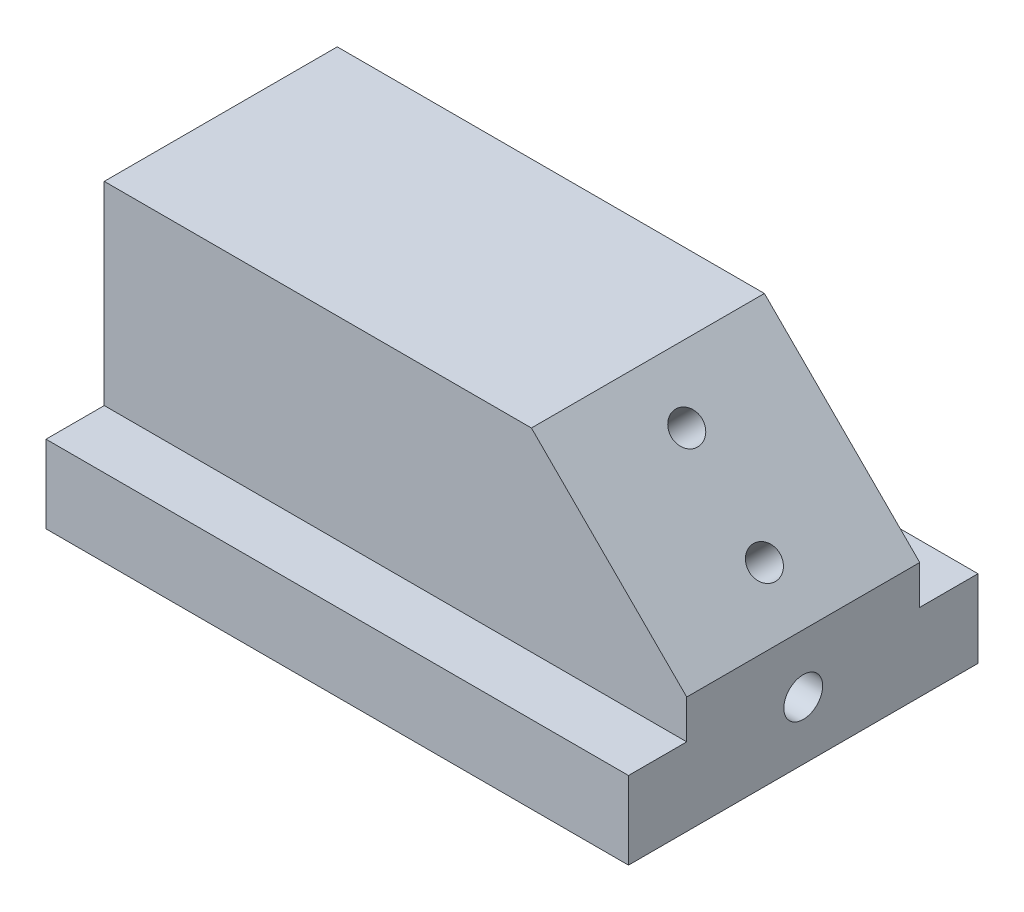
ISO-10303-21;
HEADER;
FILE_DESCRIPTION(('STEP AP214'),'2;1');
FILE_NAME('part.step','',(''),(''),'','','');
FILE_SCHEMA(('AUTOMOTIVE_DESIGN { 1 0 10303 214 1 1 1 1 }'));
ENDSEC;
DATA;
#1=APPLICATION_CONTEXT('core data for automotive mechanical design processes');
#2=APPLICATION_PROTOCOL_DEFINITION('international standard','automotive_design',2000,#1);
#3=PRODUCT_CONTEXT('',#1,'mechanical');
#4=PRODUCT('Part','Part','',(#3));
#5=PRODUCT_RELATED_PRODUCT_CATEGORY('part','',(#4));
#6=PRODUCT_DEFINITION_FORMATION('','',#4);
#7=PRODUCT_DEFINITION_CONTEXT('part definition',#1,'design');
#8=PRODUCT_DEFINITION('design','',#6,#7);
#9=PRODUCT_DEFINITION_SHAPE('','',#8);
#10=(LENGTH_UNIT() NAMED_UNIT(*) SI_UNIT(.MILLI.,.METRE.));
#11=(NAMED_UNIT(*) PLANE_ANGLE_UNIT() SI_UNIT($,.RADIAN.));
#12=(NAMED_UNIT(*) SI_UNIT($,.STERADIAN.) SOLID_ANGLE_UNIT());
#13=UNCERTAINTY_MEASURE_WITH_UNIT(LENGTH_MEASURE(1.E-05),#10,'distance_accuracy_value','');
#14=(GEOMETRIC_REPRESENTATION_CONTEXT(3) GLOBAL_UNCERTAINTY_ASSIGNED_CONTEXT((#13)) GLOBAL_UNIT_ASSIGNED_CONTEXT((#10,
#11,#12)) REPRESENTATION_CONTEXT('',''));
#15=CARTESIAN_POINT('',(0.,0.,0.));
#16=DIRECTION('',(0.,0.,1.));
#17=DIRECTION('',(1.,0.,0.));
#18=AXIS2_PLACEMENT_3D('',#15,#16,#17);
#19=CARTESIAN_POINT('',(-110.,0.,60.));
#20=DIRECTION('',(0.,-1.,0.));
#21=DIRECTION('',(0.,0.,-1.));
#22=AXIS2_PLACEMENT_3D('',#19,#20,#21);
#23=PLANE('',#22);
#24=DIRECTION('',(-1.,0.,0.));
#25=VECTOR('',#24,1.);
#26=CARTESIAN_POINT('',(-110.,0.,0.));
#27=LINE('',#26,#25);
#28=CARTESIAN_POINT('',(0.,0.,0.));
#29=VERTEX_POINT('',#28);
#30=CARTESIAN_POINT('',(-110.,0.,0.));
#31=VERTEX_POINT('',#30);
#32=EDGE_CURVE('E170',#29,#31,#27,.T.);
#33=ORIENTED_EDGE('',*,*,#32,.T.);
#34=DIRECTION('',(0.,0.,-1.));
#35=VECTOR('',#34,1.);
#36=CARTESIAN_POINT('',(-110.,0.,60.));
#37=LINE('',#36,#35);
#38=CARTESIAN_POINT('',(-110.,0.,60.));
#39=VERTEX_POINT('',#38);
#40=EDGE_CURVE('E11',#39,#31,#37,.T.);
#41=ORIENTED_EDGE('',*,*,#40,.F.);
#42=DIRECTION('',(-1.,0.,0.));
#43=VECTOR('',#42,1.);
#44=CARTESIAN_POINT('',(-110.,0.,60.));
#45=LINE('',#44,#43);
#46=CARTESIAN_POINT('',(0.,0.,60.));
#47=VERTEX_POINT('',#46);
#48=EDGE_CURVE('E171',#47,#39,#45,.T.);
#49=ORIENTED_EDGE('',*,*,#48,.F.);
#50=DIRECTION('',(0.,0.,-1.));
#51=VECTOR('',#50,1.);
#52=CARTESIAN_POINT('',(0.,0.,60.));
#53=LINE('',#52,#51);
#54=EDGE_CURVE('E181',#47,#29,#53,.T.);
#55=ORIENTED_EDGE('',*,*,#54,.T.);
#56=EDGE_LOOP('',(#33,#41,#49,#55));
#57=FACE_BOUND('',#56,.T.);
#58=ADVANCED_FACE('F33',(#57),#23,.F.);
#59=CARTESIAN_POINT('',(-110.,-70.,60.));
#60=DIRECTION('',(1.,0.,0.));
#61=DIRECTION('',(0.,0.,-1.));
#62=AXIS2_PLACEMENT_3D('',#59,#60,#61);
#63=PLANE('',#62);
#64=DIRECTION('',(0.,-1.,0.));
#65=VECTOR('',#64,1.);
#66=CARTESIAN_POINT('',(-110.,-70.,0.));
#67=LINE('',#66,#65);
#68=CARTESIAN_POINT('',(-110.,-50.,0.));
#69=VERTEX_POINT('',#68);
#70=EDGE_CURVE('E184',#31,#69,#67,.T.);
#71=ORIENTED_EDGE('',*,*,#70,.T.);
#72=DIRECTION('',(0.,0.,-1.));
#73=VECTOR('',#72,1.);
#74=CARTESIAN_POINT('',(-110.,-50.,0.));
#75=LINE('',#74,#73);
#76=CARTESIAN_POINT('',(-110.,-50.,-15.));
#77=VERTEX_POINT('',#76);
#78=EDGE_CURVE('E145',#69,#77,#75,.T.);
#79=ORIENTED_EDGE('',*,*,#78,.T.);
#80=DIRECTION('',(0.,-1.,0.));
#81=VECTOR('',#80,1.);
#82=CARTESIAN_POINT('',(-110.,-70.,-15.));
#83=LINE('',#82,#81);
#84=CARTESIAN_POINT('',(-110.,-70.,-15.));
#85=VERTEX_POINT('',#84);
#86=EDGE_CURVE('E142',#77,#85,#83,.T.);
#87=ORIENTED_EDGE('',*,*,#86,.T.);
#88=DIRECTION('',(0.,0.,-1.));
#89=VECTOR('',#88,1.);
#90=CARTESIAN_POINT('',(-110.,-70.,60.));
#91=LINE('',#90,#89);
#92=CARTESIAN_POINT('',(-110.,-70.,75.));
#93=VERTEX_POINT('',#92);
#94=EDGE_CURVE('E40',#93,#85,#91,.T.);
#95=ORIENTED_EDGE('',*,*,#94,.F.);
#96=DIRECTION('',(0.,1.,0.));
#97=VECTOR('',#96,1.);
#98=CARTESIAN_POINT('',(-110.,-70.,75.));
#99=LINE('',#98,#97);
#100=CARTESIAN_POINT('',(-110.,-50.,75.));
#101=VERTEX_POINT('',#100);
#102=EDGE_CURVE('E135',#93,#101,#99,.T.);
#103=ORIENTED_EDGE('',*,*,#102,.T.);
#104=DIRECTION('',(0.,0.,-1.));
#105=VECTOR('',#104,1.);
#106=CARTESIAN_POINT('',(-110.,-50.,60.));
#107=LINE('',#106,#105);
#108=CARTESIAN_POINT('',(-110.,-50.,60.));
#109=VERTEX_POINT('',#108);
#110=EDGE_CURVE('E112',#101,#109,#107,.T.);
#111=ORIENTED_EDGE('',*,*,#110,.T.);
#112=DIRECTION('',(0.,-1.,0.));
#113=VECTOR('',#112,1.);
#114=CARTESIAN_POINT('',(-110.,-70.,60.));
#115=LINE('',#114,#113);
#116=EDGE_CURVE('E174',#39,#109,#115,.T.);
#117=ORIENTED_EDGE('',*,*,#116,.F.);
#118=ORIENTED_EDGE('',*,*,#40,.T.);
#119=EDGE_LOOP('',(#71,#79,#87,#95,#103,#111,#117,#118));
#120=FACE_BOUND('',#119,.T.);
#121=ADVANCED_FACE('F201',(#120),#63,.F.);
#122=CARTESIAN_POINT('',(40.0000000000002,-70.,60.));
#123=DIRECTION('',(0.,1.,0.));
#124=DIRECTION('',(-1.,0.,0.));
#125=AXIS2_PLACEMENT_3D('',#122,#123,#124);
#126=PLANE('',#125);
#127=ORIENTED_EDGE('',*,*,#94,.T.);
#128=DIRECTION('',(1.,0.,0.));
#129=VECTOR('',#128,1.);
#130=CARTESIAN_POINT('',(-135.,-70.,-15.));
#131=LINE('',#130,#129);
#132=CARTESIAN_POINT('',(40.0000000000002,-70.,-15.));
#133=VERTEX_POINT('',#132);
#134=EDGE_CURVE('E153',#85,#133,#131,.T.);
#135=ORIENTED_EDGE('',*,*,#134,.T.);
#136=DIRECTION('',(0.,0.,-1.));
#137=VECTOR('',#136,1.);
#138=CARTESIAN_POINT('',(40.0000000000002,-70.,60.));
#139=LINE('',#138,#137);
#140=CARTESIAN_POINT('',(40.0000000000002,-70.,75.));
#141=VERTEX_POINT('',#140);
#142=EDGE_CURVE('E194',#141,#133,#139,.T.);
#143=ORIENTED_EDGE('',*,*,#142,.F.);
#144=DIRECTION('',(1.,0.,0.));
#145=VECTOR('',#144,1.);
#146=CARTESIAN_POINT('',(-135.,-70.,75.));
#147=LINE('',#146,#145);
#148=EDGE_CURVE('E115',#93,#141,#147,.T.);
#149=ORIENTED_EDGE('',*,*,#148,.F.);
#150=EDGE_LOOP('',(#127,#135,#143,#149));
#151=FACE_BOUND('',#150,.T.);
#152=ADVANCED_FACE('F196',(#151),#126,.F.);
#153=CARTESIAN_POINT('',(40.0000000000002,-40.,60.));
#154=DIRECTION('',(-1.,0.,0.));
#155=DIRECTION('',(0.,0.,1.));
#156=AXIS2_PLACEMENT_3D('',#153,#154,#155);
#157=PLANE('',#156);
#158=CARTESIAN_POINT('',(40.0000000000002,-55.,30.));
#159=DIRECTION('',(1.,0.,0.));
#160=DIRECTION('',(0.,0.,-1.));
#161=AXIS2_PLACEMENT_3D('',#158,#159,#160);
#162=CIRCLE('',#161,5.);
#163=CARTESIAN_POINT('',(40.0000000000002,-55.,25.));
#164=VERTEX_POINT('',#163);
#165=EDGE_CURVE('E132',#164,#164,#162,.T.);
#166=ORIENTED_EDGE('',*,*,#165,.F.);
#167=EDGE_LOOP('',(#166));
#168=FACE_BOUND('',#167,.T.);
#169=ORIENTED_EDGE('',*,*,#142,.T.);
#170=DIRECTION('',(0.,1.,0.));
#171=VECTOR('',#170,1.);
#172=CARTESIAN_POINT('',(40.0000000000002,-70.,-15.));
#173=LINE('',#172,#171);
#174=CARTESIAN_POINT('',(40.0000000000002,-50.,-15.));
#175=VERTEX_POINT('',#174);
#176=EDGE_CURVE('E141',#133,#175,#173,.T.);
#177=ORIENTED_EDGE('',*,*,#176,.T.);
#178=DIRECTION('',(0.,0.,1.));
#179=VECTOR('',#178,1.);
#180=CARTESIAN_POINT('',(40.0000000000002,-50.,0.));
#181=LINE('',#180,#179);
#182=CARTESIAN_POINT('',(40.0000000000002,-50.,0.));
#183=VERTEX_POINT('',#182);
#184=EDGE_CURVE('E150',#175,#183,#181,.T.);
#185=ORIENTED_EDGE('',*,*,#184,.T.);
#186=DIRECTION('',(0.,1.,0.));
#187=VECTOR('',#186,1.);
#188=CARTESIAN_POINT('',(40.0000000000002,-40.,0.));
#189=LINE('',#188,#187);
#190=CARTESIAN_POINT('',(40.0000000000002,-40.,0.));
#191=VERTEX_POINT('',#190);
#192=EDGE_CURVE('E186',#183,#191,#189,.T.);
#193=ORIENTED_EDGE('',*,*,#192,.T.);
#194=DIRECTION('',(0.,0.,-1.));
#195=VECTOR('',#194,1.);
#196=CARTESIAN_POINT('',(40.0000000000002,-40.,60.));
#197=LINE('',#196,#195);
#198=CARTESIAN_POINT('',(40.0000000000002,-40.,60.));
#199=VERTEX_POINT('',#198);
#200=EDGE_CURVE('E191',#199,#191,#197,.T.);
#201=ORIENTED_EDGE('',*,*,#200,.F.);
#202=DIRECTION('',(0.,1.,0.));
#203=VECTOR('',#202,1.);
#204=CARTESIAN_POINT('',(40.0000000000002,-40.,60.));
#205=LINE('',#204,#203);
#206=CARTESIAN_POINT('',(40.0000000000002,-50.,60.));
#207=VERTEX_POINT('',#206);
#208=EDGE_CURVE('E128',#207,#199,#205,.T.);
#209=ORIENTED_EDGE('',*,*,#208,.F.);
#210=DIRECTION('',(0.,0.,1.));
#211=VECTOR('',#210,1.);
#212=CARTESIAN_POINT('',(40.0000000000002,-50.,60.));
#213=LINE('',#212,#211);
#214=CARTESIAN_POINT('',(40.0000000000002,-50.,75.));
#215=VERTEX_POINT('',#214);
#216=EDGE_CURVE('E47',#207,#215,#213,.T.);
#217=ORIENTED_EDGE('',*,*,#216,.T.);
#218=DIRECTION('',(0.,-1.,0.));
#219=VECTOR('',#218,1.);
#220=CARTESIAN_POINT('',(40.0000000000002,-70.,75.));
#221=LINE('',#220,#219);
#222=EDGE_CURVE('E120',#215,#141,#221,.T.);
#223=ORIENTED_EDGE('',*,*,#222,.T.);
#224=EDGE_LOOP('',(#169,#177,#185,#193,#201,#209,#217,#223));
#225=FACE_BOUND('',#224,.T.);
#226=ADVANCED_FACE('F126',(#168,#225),#157,.F.);
#227=CARTESIAN_POINT('',(0.,0.,60.));
#228=DIRECTION('',(-0.707106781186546,-0.707106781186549,0.));
#229=DIRECTION('',(0.707106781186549,-0.707106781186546,0.));
#230=AXIS2_PLACEMENT_3D('',#227,#228,#229);
#231=PLANE('',#230);
#232=CARTESIAN_POINT('',(10.,-9.99999999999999,30.));
#233=DIRECTION('',(0.707106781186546,0.707106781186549,0.));
#234=DIRECTION('',(-0.707106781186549,0.707106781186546,0.));
#235=AXIS2_PLACEMENT_3D('',#232,#233,#234);
#236=CIRCLE('',#235,3.99999999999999);
#237=CARTESIAN_POINT('',(7.17157287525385,-7.17157287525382,30.));
#238=VERTEX_POINT('',#237);
#239=EDGE_CURVE('E147',#238,#238,#236,.T.);
#240=ORIENTED_EDGE('',*,*,#239,.F.);
#241=EDGE_LOOP('',(#240));
#242=FACE_BOUND('',#241,.T.);
#243=CARTESIAN_POINT('',(30.0000000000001,-30.,30.));
#244=DIRECTION('',(0.707106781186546,0.707106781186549,0.));
#245=DIRECTION('',(-0.707106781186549,0.707106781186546,0.));
#246=AXIS2_PLACEMENT_3D('',#243,#244,#245);
#247=CIRCLE('',#246,3.99999999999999);
#248=CARTESIAN_POINT('',(27.1715728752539,-27.1715728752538,30.));
#249=VERTEX_POINT('',#248);
#250=EDGE_CURVE('E164',#249,#249,#247,.T.);
#251=ORIENTED_EDGE('',*,*,#250,.F.);
#252=EDGE_LOOP('',(#251));
#253=FACE_BOUND('',#252,.T.);
#254=DIRECTION('',(-0.707106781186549,0.707106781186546,0.));
#255=VECTOR('',#254,1.);
#256=CARTESIAN_POINT('',(0.,0.,0.));
#257=LINE('',#256,#255);
#258=EDGE_CURVE('E175',#191,#29,#257,.T.);
#259=ORIENTED_EDGE('',*,*,#258,.T.);
#260=ORIENTED_EDGE('',*,*,#54,.F.);
#261=DIRECTION('',(-0.707106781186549,0.707106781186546,0.));
#262=VECTOR('',#261,1.);
#263=CARTESIAN_POINT('',(0.,0.,60.));
#264=LINE('',#263,#262);
#265=EDGE_CURVE('E179',#199,#47,#264,.T.);
#266=ORIENTED_EDGE('',*,*,#265,.F.);
#267=ORIENTED_EDGE('',*,*,#200,.T.);
#268=EDGE_LOOP('',(#259,#260,#266,#267));
#269=FACE_BOUND('',#268,.T.);
#270=ADVANCED_FACE('F238',(#242,#253,#269),#231,.F.);
#271=CARTESIAN_POINT('',(0.,0.,60.));
#272=DIRECTION('',(0.,0.,-1.));
#273=DIRECTION('',(-1.,0.,0.));
#274=AXIS2_PLACEMENT_3D('',#271,#272,#273);
#275=PLANE('',#274);
#276=ORIENTED_EDGE('',*,*,#116,.T.);
#277=DIRECTION('',(1.,0.,0.));
#278=VECTOR('',#277,1.);
#279=CARTESIAN_POINT('',(-135.,-50.,60.));
#280=LINE('',#279,#278);
#281=EDGE_CURVE('E116',#109,#207,#280,.T.);
#282=ORIENTED_EDGE('',*,*,#281,.T.);
#283=ORIENTED_EDGE('',*,*,#208,.T.);
#284=ORIENTED_EDGE('',*,*,#265,.T.);
#285=ORIENTED_EDGE('',*,*,#48,.T.);
#286=EDGE_LOOP('',(#276,#282,#283,#284,#285));
#287=FACE_BOUND('',#286,.T.);
#288=ADVANCED_FACE('F235',(#287),#275,.F.);
#289=CARTESIAN_POINT('',(0.,0.,0.));
#290=DIRECTION('',(0.,0.,-1.));
#291=DIRECTION('',(-1.,0.,0.));
#292=AXIS2_PLACEMENT_3D('',#289,#290,#291);
#293=PLANE('',#292);
#294=DIRECTION('',(1.,0.,0.));
#295=VECTOR('',#294,1.);
#296=CARTESIAN_POINT('',(-135.,-50.,0.));
#297=LINE('',#296,#295);
#298=EDGE_CURVE('E55',#69,#183,#297,.T.);
#299=ORIENTED_EDGE('',*,*,#298,.F.);
#300=ORIENTED_EDGE('',*,*,#70,.F.);
#301=ORIENTED_EDGE('',*,*,#32,.F.);
#302=ORIENTED_EDGE('',*,*,#258,.F.);
#303=ORIENTED_EDGE('',*,*,#192,.F.);
#304=EDGE_LOOP('',(#299,#300,#301,#302,#303));
#305=FACE_BOUND('',#304,.T.);
#306=ADVANCED_FACE('F233',(#305),#293,.T.);
#307=CARTESIAN_POINT('',(19.3933982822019,-40.6066017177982,30.));
#308=DIRECTION('',(0.707106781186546,0.707106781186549,0.));
#309=DIRECTION('',(-0.707106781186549,0.707106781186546,0.));
#310=AXIS2_PLACEMENT_3D('',#307,#308,#309);
#311=CONICAL_SURFACE('',#310,3.99999999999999,1.02974425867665);
#312=CARTESIAN_POINT('',(17.6939078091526,-42.3060921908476,30.));
#313=VERTEX_POINT('',#312);
#314=VERTEX_LOOP('',#313);
#315=FACE_BOUND('',#314,.T.);
#316=CARTESIAN_POINT('',(19.3933982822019,-40.6066017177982,30.));
#317=DIRECTION('',(0.707106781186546,0.707106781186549,0.));
#318=DIRECTION('',(-0.707106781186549,0.707106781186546,0.));
#319=AXIS2_PLACEMENT_3D('',#316,#317,#318);
#320=CIRCLE('',#319,3.99999999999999);
#321=CARTESIAN_POINT('',(16.5649711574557,-37.778174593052,30.));
#322=VERTEX_POINT('',#321);
#323=EDGE_CURVE('E167',#322,#322,#320,.T.);
#324=ORIENTED_EDGE('',*,*,#323,.T.);
#325=EDGE_LOOP('',(#324));
#326=FACE_BOUND('',#325,.T.);
#327=ADVANCED_FACE('F310',(#315,#326),#311,.F.);
#328=CARTESIAN_POINT('',(30.0000000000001,-30.,30.));
#329=DIRECTION('',(0.707106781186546,0.707106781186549,0.));
#330=DIRECTION('',(-0.707106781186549,0.707106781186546,0.));
#331=AXIS2_PLACEMENT_3D('',#328,#329,#330);
#332=CYLINDRICAL_SURFACE('',#331,3.99999999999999);
#333=ORIENTED_EDGE('',*,*,#323,.F.);
#334=EDGE_LOOP('',(#333));
#335=FACE_BOUND('',#334,.T.);
#336=ORIENTED_EDGE('',*,*,#250,.T.);
#337=EDGE_LOOP('',(#336));
#338=FACE_BOUND('',#337,.T.);
#339=ADVANCED_FACE('F330',(#335,#338),#332,.F.);
#340=CARTESIAN_POINT('',(-0.606601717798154,-20.6066017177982,30.));
#341=DIRECTION('',(0.707106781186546,0.707106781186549,0.));
#342=DIRECTION('',(-0.707106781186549,0.707106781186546,0.));
#343=AXIS2_PLACEMENT_3D('',#340,#341,#342);
#344=CONICAL_SURFACE('',#343,3.99999999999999,1.02974425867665);
#345=CARTESIAN_POINT('',(-2.30609219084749,-22.3060921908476,30.));
#346=VERTEX_POINT('',#345);
#347=VERTEX_LOOP('',#346);
#348=FACE_BOUND('',#347,.T.);
#349=CARTESIAN_POINT('',(-0.606601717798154,-20.6066017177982,30.));
#350=DIRECTION('',(0.707106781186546,0.707106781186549,0.));
#351=DIRECTION('',(-0.707106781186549,0.707106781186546,0.));
#352=AXIS2_PLACEMENT_3D('',#349,#350,#351);
#353=CIRCLE('',#352,3.99999999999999);
#354=CARTESIAN_POINT('',(-3.43502884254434,-17.7781745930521,30.));
#355=VERTEX_POINT('',#354);
#356=EDGE_CURVE('E161',#355,#355,#353,.T.);
#357=ORIENTED_EDGE('',*,*,#356,.T.);
#358=EDGE_LOOP('',(#357));
#359=FACE_BOUND('',#358,.T.);
#360=ADVANCED_FACE('F218',(#348,#359),#344,.F.);
#361=CARTESIAN_POINT('',(10.,-9.99999999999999,30.));
#362=DIRECTION('',(0.707106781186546,0.707106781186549,0.));
#363=DIRECTION('',(-0.707106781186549,0.707106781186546,0.));
#364=AXIS2_PLACEMENT_3D('',#361,#362,#363);
#365=CYLINDRICAL_SURFACE('',#364,3.99999999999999);
#366=ORIENTED_EDGE('',*,*,#356,.F.);
#367=EDGE_LOOP('',(#366));
#368=FACE_BOUND('',#367,.T.);
#369=ORIENTED_EDGE('',*,*,#239,.T.);
#370=EDGE_LOOP('',(#369));
#371=FACE_BOUND('',#370,.T.);
#372=ADVANCED_FACE('F210',(#368,#371),#365,.F.);
#373=CARTESIAN_POINT('',(-135.,-50.,0.));
#374=DIRECTION('',(0.,1.,0.));
#375=DIRECTION('',(0.,0.,1.));
#376=AXIS2_PLACEMENT_3D('',#373,#374,#375);
#377=PLANE('',#376);
#378=ORIENTED_EDGE('',*,*,#78,.F.);
#379=ORIENTED_EDGE('',*,*,#298,.T.);
#380=ORIENTED_EDGE('',*,*,#184,.F.);
#381=DIRECTION('',(1.,0.,0.));
#382=VECTOR('',#381,1.);
#383=CARTESIAN_POINT('',(-135.,-50.,-15.));
#384=LINE('',#383,#382);
#385=EDGE_CURVE('E155',#77,#175,#384,.T.);
#386=ORIENTED_EDGE('',*,*,#385,.F.);
#387=EDGE_LOOP('',(#378,#379,#380,#386));
#388=FACE_BOUND('',#387,.T.);
#389=ADVANCED_FACE('F208',(#388),#377,.T.);
#390=CARTESIAN_POINT('',(-135.,-70.,-15.));
#391=DIRECTION('',(0.,0.,-1.));
#392=DIRECTION('',(-1.,0.,0.));
#393=AXIS2_PLACEMENT_3D('',#390,#391,#392);
#394=PLANE('',#393);
#395=ORIENTED_EDGE('',*,*,#86,.F.);
#396=ORIENTED_EDGE('',*,*,#385,.T.);
#397=ORIENTED_EDGE('',*,*,#176,.F.);
#398=ORIENTED_EDGE('',*,*,#134,.F.);
#399=EDGE_LOOP('',(#395,#396,#397,#398));
#400=FACE_BOUND('',#399,.T.);
#401=ADVANCED_FACE('F205',(#400),#394,.T.);
#402=CARTESIAN_POINT('',(-135.,-70.,75.));
#403=DIRECTION('',(0.,0.,1.));
#404=DIRECTION('',(1.,0.,0.));
#405=AXIS2_PLACEMENT_3D('',#402,#403,#404);
#406=PLANE('',#405);
#407=ORIENTED_EDGE('',*,*,#102,.F.);
#408=ORIENTED_EDGE('',*,*,#148,.T.);
#409=ORIENTED_EDGE('',*,*,#222,.F.);
#410=DIRECTION('',(1.,0.,0.));
#411=VECTOR('',#410,1.);
#412=CARTESIAN_POINT('',(-135.,-50.,75.));
#413=LINE('',#412,#411);
#414=EDGE_CURVE('E109',#101,#215,#413,.T.);
#415=ORIENTED_EDGE('',*,*,#414,.F.);
#416=EDGE_LOOP('',(#407,#408,#409,#415));
#417=FACE_BOUND('',#416,.T.);
#418=ADVANCED_FACE('F121',(#417),#406,.T.);
#419=CARTESIAN_POINT('',(-135.,-50.,60.));
#420=DIRECTION('',(0.,1.,0.));
#421=DIRECTION('',(0.,0.,1.));
#422=AXIS2_PLACEMENT_3D('',#419,#420,#421);
#423=PLANE('',#422);
#424=ORIENTED_EDGE('',*,*,#110,.F.);
#425=ORIENTED_EDGE('',*,*,#414,.T.);
#426=ORIENTED_EDGE('',*,*,#216,.F.);
#427=ORIENTED_EDGE('',*,*,#281,.F.);
#428=EDGE_LOOP('',(#424,#425,#426,#427));
#429=FACE_BOUND('',#428,.T.);
#430=ADVANCED_FACE('F111',(#429),#423,.T.);
#431=CARTESIAN_POINT('',(20.0000000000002,-55.,30.));
#432=DIRECTION('',(1.,0.,0.));
#433=DIRECTION('',(0.,0.,-1.));
#434=AXIS2_PLACEMENT_3D('',#431,#432,#433);
#435=CYLINDRICAL_SURFACE('',#434,5.);
#436=CARTESIAN_POINT('',(20.0000000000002,-55.,30.));
#437=DIRECTION('',(1.,0.,0.));
#438=DIRECTION('',(0.,0.,-1.));
#439=AXIS2_PLACEMENT_3D('',#436,#437,#438);
#440=CIRCLE('',#439,5.);
#441=CARTESIAN_POINT('',(20.0000000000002,-55.,25.));
#442=VERTEX_POINT('',#441);
#443=EDGE_CURVE('E129',#442,#442,#440,.T.);
#444=ORIENTED_EDGE('',*,*,#443,.F.);
#445=EDGE_LOOP('',(#444));
#446=FACE_BOUND('',#445,.T.);
#447=ORIENTED_EDGE('',*,*,#165,.T.);
#448=EDGE_LOOP('',(#447));
#449=FACE_BOUND('',#448,.T.);
#450=ADVANCED_FACE('F273',(#446,#449),#435,.F.);
#451=CARTESIAN_POINT('',(20.0000000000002,-55.,30.));
#452=DIRECTION('',(1.,0.,0.));
#453=DIRECTION('',(0.,0.,-1.));
#454=AXIS2_PLACEMENT_3D('',#451,#452,#453);
#455=PLANE('',#454);
#456=ORIENTED_EDGE('',*,*,#443,.T.);
#457=EDGE_LOOP('',(#456));
#458=FACE_BOUND('',#457,.T.);
#459=ADVANCED_FACE('F278',(#458),#455,.T.);
#460=CLOSED_SHELL('',(#58,#121,#152,#226,#270,#288,#306,#327,#339,#360,#372,#389,#401,#418,#430,
#450,#459));
#461=MANIFOLD_SOLID_BREP('B2',#460);
#462=ADVANCED_BREP_SHAPE_REPRESENTATION('',(#18,#461),#14);
#463=SHAPE_DEFINITION_REPRESENTATION(#9,#462);
ENDSEC;
END-ISO-10303-21;
